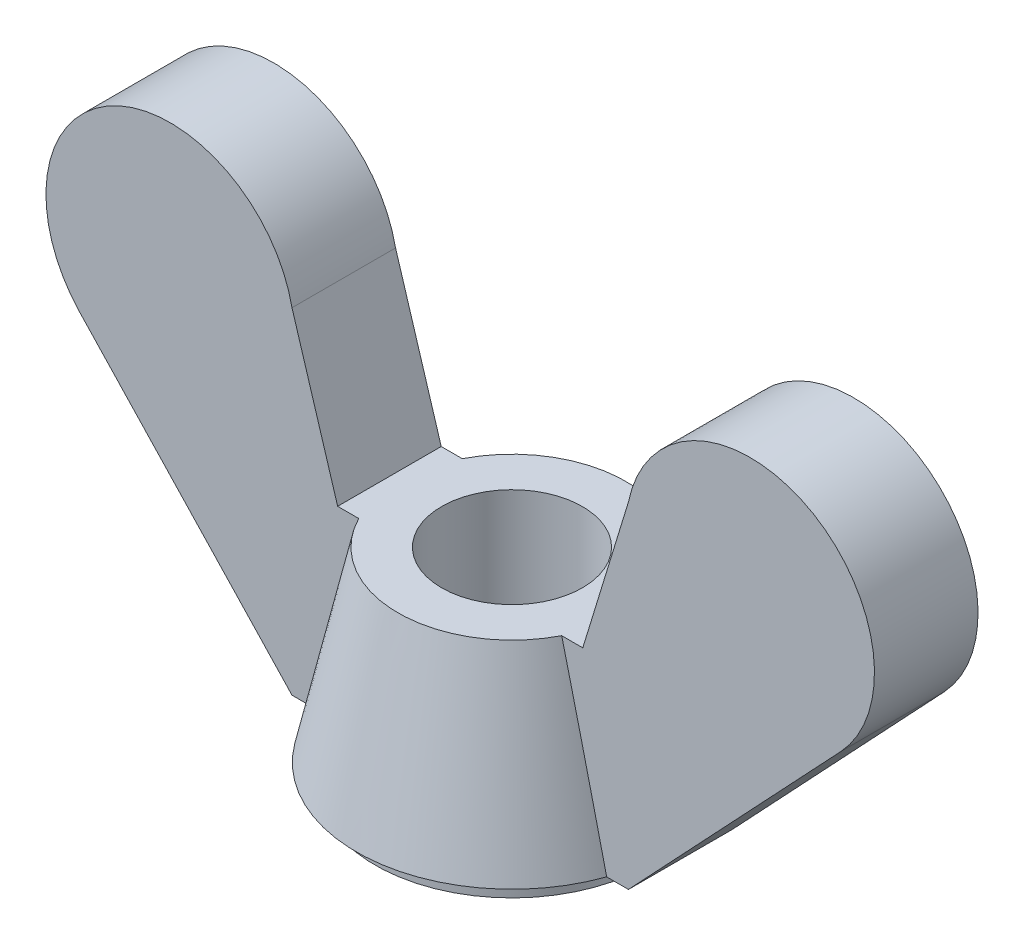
ISO-10303-21;
HEADER;
FILE_DESCRIPTION(('STEP AP214'),'2;1');
FILE_NAME('part.step','',(''),(''),'','','');
FILE_SCHEMA(('AUTOMOTIVE_DESIGN { 1 0 10303 214 1 1 1 1 }'));
ENDSEC;
DATA;
#1=APPLICATION_CONTEXT('core data for automotive mechanical design processes');
#2=APPLICATION_PROTOCOL_DEFINITION('international standard','automotive_design',2000,#1);
#3=PRODUCT_CONTEXT('',#1,'mechanical');
#4=PRODUCT('Part','Part','',(#3));
#5=PRODUCT_RELATED_PRODUCT_CATEGORY('part','',(#4));
#6=PRODUCT_DEFINITION_FORMATION('','',#4);
#7=PRODUCT_DEFINITION_CONTEXT('part definition',#1,'design');
#8=PRODUCT_DEFINITION('design','',#6,#7);
#9=PRODUCT_DEFINITION_SHAPE('','',#8);
#10=(LENGTH_UNIT() NAMED_UNIT(*) SI_UNIT(.MILLI.,.METRE.));
#11=(NAMED_UNIT(*) PLANE_ANGLE_UNIT() SI_UNIT($,.RADIAN.));
#12=(NAMED_UNIT(*) SI_UNIT($,.STERADIAN.) SOLID_ANGLE_UNIT());
#13=UNCERTAINTY_MEASURE_WITH_UNIT(LENGTH_MEASURE(1.E-05),#10,'distance_accuracy_value','');
#14=(GEOMETRIC_REPRESENTATION_CONTEXT(3) GLOBAL_UNCERTAINTY_ASSIGNED_CONTEXT((#13)) GLOBAL_UNIT_ASSIGNED_CONTEXT((#10,
#11,#12)) REPRESENTATION_CONTEXT('',''));
#15=CARTESIAN_POINT('',(0.,0.,0.));
#16=DIRECTION('',(0.,0.,1.));
#17=DIRECTION('',(1.,0.,0.));
#18=AXIS2_PLACEMENT_3D('',#15,#16,#17);
#19=CARTESIAN_POINT('',(0.,1.,0.));
#20=DIRECTION('',(0.,-1.,0.));
#21=DIRECTION('',(0.,0.,-1.));
#22=AXIS2_PLACEMENT_3D('',#19,#20,#21);
#23=CONICAL_SURFACE('',#22,7.5,0.218668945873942);
#24=CARTESIAN_POINT('',(0.,10.,0.));
#25=DIRECTION('',(0.,-1.,0.));
#26=DIRECTION('',(0.,0.,-1.));
#27=AXIS2_PLACEMENT_3D('',#24,#25,#26);
#28=CIRCLE('',#27,5.5);
#29=CARTESIAN_POINT('',(-4.89897948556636,10.,-2.5));
#30=VERTEX_POINT('',#29);
#31=CARTESIAN_POINT('',(4.89897948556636,10.,-2.5));
#32=VERTEX_POINT('',#31);
#33=EDGE_CURVE('E231',#30,#32,#28,.T.);
#34=ORIENTED_EDGE('',*,*,#33,.T.);
#35=CARTESIAN_POINT('',(3.9309370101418,13.7864391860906,-2.5));
#36=CARTESIAN_POINT('',(4.0121829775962,13.4779082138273,-2.5));
#37=CARTESIAN_POINT('',(4.09276538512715,13.1692034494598,-2.5));
#38=CARTESIAN_POINT('',(4.25278684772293,12.5514989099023,-2.5));
#39=CARTESIAN_POINT('',(4.33222590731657,12.242499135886,-2.5));
#40=CARTESIAN_POINT('',(4.56910244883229,11.3151411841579,-2.5));
#41=CARTESIAN_POINT('',(4.72510156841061,10.6964156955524,-2.5));
#42=CARTESIAN_POINT('',(5.03424789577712,9.45827789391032,-2.5));
#43=CARTESIAN_POINT('',(5.18739520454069,8.83886560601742,-2.5));
#44=CARTESIAN_POINT('',(5.49150237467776,7.59950246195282,-2.5));
#45=CARTESIAN_POINT('',(5.64246222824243,6.97955160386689,-2.5));
#46=CARTESIAN_POINT('',(5.95750029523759,5.67793179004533,-2.5));
#47=CARTESIAN_POINT('',(6.12140018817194,4.99621971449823,-2.5));
#48=CARTESIAN_POINT('',(6.44757017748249,3.63239887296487,-2.5));
#49=CARTESIAN_POINT('',(6.60984025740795,2.95029010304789,-2.5));
#50=CARTESIAN_POINT('',(6.99933811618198,1.30604131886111,-2.5));
#51=CARTESIAN_POINT('',(7.22592150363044,0.343748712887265,-2.5));
#52=CARTESIAN_POINT('',(7.67714018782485,-1.58129367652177,-2.5));
#53=CARTESIAN_POINT('',(7.90177548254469,-2.54404346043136,-2.5));
#54=CARTESIAN_POINT('',(8.34953415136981,-4.46986091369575,-2.5));
#55=CARTESIAN_POINT('',(8.57265757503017,-5.43292857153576,-2.5));
#56=CARTESIAN_POINT('',(9.01769816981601,-7.35933994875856,-2.5));
#57=CARTESIAN_POINT('',(9.23961534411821,-8.32268366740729,-2.5));
#58=CARTESIAN_POINT('',(9.46107907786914,-9.28613119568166,-2.5));
#59=B_SPLINE_CURVE_WITH_KNOTS('',3,(#35,#36,#37,#38,#39,#40,#41,#42,#43,#44,#45,#46,#47,#48,#49,
#50,#51,#52,#53,#54,#55,#56,#57,#58),.UNSPECIFIED.,.F.,.F.,(4,2,2,2,2,2,2,2,2,2,2,4),(0.,
0.95714489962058,1.91428600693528,3.8285412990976,5.74272868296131,7.65692289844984,
9.76033440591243,11.8637671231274,14.8295901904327,17.7954163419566,20.7611448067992,
23.7268654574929),.UNSPECIFIED.);
#60=CARTESIAN_POINT('',(7.07106781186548,1.,-2.5));
#61=VERTEX_POINT('',#60);
#62=EDGE_CURVE('E133',#32,#61,#59,.T.);
#63=ORIENTED_EDGE('',*,*,#62,.T.);
#64=CARTESIAN_POINT('',(0.,1.,0.));
#65=DIRECTION('',(0.,-1.,0.));
#66=DIRECTION('',(0.,0.,-1.));
#67=AXIS2_PLACEMENT_3D('',#64,#65,#66);
#68=CIRCLE('',#67,7.5);
#69=CARTESIAN_POINT('',(-7.07106781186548,1.,-2.5));
#70=VERTEX_POINT('',#69);
#71=EDGE_CURVE('E235',#70,#61,#68,.T.);
#72=ORIENTED_EDGE('',*,*,#71,.F.);
#73=CARTESIAN_POINT('',(-9.46107907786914,-9.28613119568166,-2.5));
#74=CARTESIAN_POINT('',(-9.23960640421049,-8.32264428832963,-2.5));
#75=CARTESIAN_POINT('',(-9.01768009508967,-7.35926124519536,-2.5));
#76=CARTESIAN_POINT('',(-8.57262214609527,-5.43277568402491,-2.5));
#77=CARTESIAN_POINT('',(-8.34949050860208,-4.46967316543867,-2.5));
#78=CARTESIAN_POINT('',(-7.90173281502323,-2.54385998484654,-2.5));
#79=CARTESIAN_POINT('',(-7.67710682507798,-1.58114930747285,-2.5));
#80=CARTESIAN_POINT('',(-7.22590463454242,0.343818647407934,-2.5));
#81=CARTESIAN_POINT('',(-6.99932842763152,1.3060759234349,-2.5));
#82=CARTESIAN_POINT('',(-6.54357636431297,3.23002662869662,-2.5));
#83=CARTESIAN_POINT('',(-6.31440037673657,4.19172002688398,-2.5));
#84=CARTESIAN_POINT('',(-5.85251092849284,6.11425116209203,-2.5));
#85=CARTESIAN_POINT('',(-5.61979749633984,7.07508890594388,-2.5));
#86=CARTESIAN_POINT('',(-5.26689744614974,8.51543264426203,-2.5));
#87=CARTESIAN_POINT('',(-5.14862280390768,8.99540694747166,-2.5));
#88=CARTESIAN_POINT('',(-4.91049880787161,9.95496363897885,-2.5));
#89=CARTESIAN_POINT('',(-4.79064945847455,10.4345460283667,-2.5));
#90=CARTESIAN_POINT('',(-4.5490056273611,11.3932353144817,-2.5));
#91=CARTESIAN_POINT('',(-4.42721109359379,11.8723421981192,-2.5));
#92=CARTESIAN_POINT('',(-4.18110501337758,12.8299134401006,-2.5));
#93=CARTESIAN_POINT('',(-4.05679344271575,13.3083777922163,-2.5));
#94=CARTESIAN_POINT('',(-3.9309370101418,13.7864391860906,-2.5));
#95=B_SPLINE_CURVE_WITH_KNOTS('',3,(#73,#74,#75,#76,#77,#78,#79,#80,#81,#82,#83,#84,#85,#86,#87,
#88,#89,#90,#91,#92,#93,#94),.UNSPECIFIED.,.F.,.F.,(4,2,2,2,2,2,2,2,2,2,4),(0.,2.96584177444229,
5.93167769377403,8.89738320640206,11.8630983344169,14.8289637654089,17.7948053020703,
19.277799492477,20.7607895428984,22.2438193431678,23.7268634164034),.UNSPECIFIED.);
#96=EDGE_CURVE('E220',#70,#30,#95,.T.);
#97=ORIENTED_EDGE('',*,*,#96,.T.);
#98=EDGE_LOOP('',(#34,#63,#72,#97));
#99=FACE_BOUND('',#98,.T.);
#100=ADVANCED_FACE('F35',(#99),#23,.T.);
#101=CARTESIAN_POINT('',(0.,0.,0.));
#102=DIRECTION('',(0.,-1.,0.));
#103=DIRECTION('',(0.,0.,-1.));
#104=AXIS2_PLACEMENT_3D('',#101,#102,#103);
#105=PLANE('',#104);
#106=CARTESIAN_POINT('',(0.,0.,0.));
#107=DIRECTION('',(0.,1.,0.));
#108=DIRECTION('',(0.,0.,1.));
#109=AXIS2_PLACEMENT_3D('',#106,#107,#108);
#110=CIRCLE('',#109,3.4);
#111=CARTESIAN_POINT('',(0.,0.,3.4));
#112=VERTEX_POINT('',#111);
#113=EDGE_CURVE('E227',#112,#112,#110,.T.);
#114=ORIENTED_EDGE('',*,*,#113,.T.);
#115=EDGE_LOOP('',(#114));
#116=FACE_BOUND('',#115,.T.);
#117=CARTESIAN_POINT('',(0.,0.,0.));
#118=DIRECTION('',(0.,-1.,0.));
#119=DIRECTION('',(0.,0.,-1.));
#120=AXIS2_PLACEMENT_3D('',#117,#118,#119);
#121=CIRCLE('',#120,6.6);
#122=CARTESIAN_POINT('',(0.,0.,-6.6));
#123=VERTEX_POINT('',#122);
#124=EDGE_CURVE('E11',#123,#123,#121,.T.);
#125=ORIENTED_EDGE('',*,*,#124,.T.);
#126=EDGE_LOOP('',(#125));
#127=FACE_BOUND('',#126,.T.);
#128=ADVANCED_FACE('F37',(#116,#127),#105,.T.);
#129=CARTESIAN_POINT('',(0.,0.,0.));
#130=DIRECTION('',(0.,-1.,0.));
#131=DIRECTION('',(0.,0.,-1.));
#132=AXIS2_PLACEMENT_3D('',#129,#130,#131);
#133=CYLINDRICAL_SURFACE('',#132,6.6);
#134=CARTESIAN_POINT('',(0.,1.,0.));
#135=DIRECTION('',(0.,-1.,0.));
#136=DIRECTION('',(0.,0.,-1.));
#137=AXIS2_PLACEMENT_3D('',#134,#135,#136);
#138=CIRCLE('',#137,6.6);
#139=CARTESIAN_POINT('',(0.,1.,-6.6));
#140=VERTEX_POINT('',#139);
#141=EDGE_CURVE('E43',#140,#140,#138,.T.);
#142=ORIENTED_EDGE('',*,*,#141,.T.);
#143=EDGE_LOOP('',(#142));
#144=FACE_BOUND('',#143,.T.);
#145=ORIENTED_EDGE('',*,*,#124,.F.);
#146=EDGE_LOOP('',(#145));
#147=FACE_BOUND('',#146,.T.);
#148=ADVANCED_FACE('F239',(#144,#147),#133,.T.);
#149=CARTESIAN_POINT('',(6.6,1.,0.));
#150=DIRECTION('',(0.,-1.,0.));
#151=DIRECTION('',(0.,0.,-1.));
#152=AXIS2_PLACEMENT_3D('',#149,#150,#151);
#153=PLANE('',#152);
#154=ORIENTED_EDGE('',*,*,#141,.F.);
#155=EDGE_LOOP('',(#154));
#156=FACE_BOUND('',#155,.T.);
#157=DIRECTION('',(-1.,0.,0.));
#158=VECTOR('',#157,1.);
#159=CARTESIAN_POINT('',(5.51083691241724,1.,2.5));
#160=LINE('',#159,#158);
#161=CARTESIAN_POINT('',(8.12131645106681,1.,2.5));
#162=VERTEX_POINT('',#161);
#163=CARTESIAN_POINT('',(7.07106781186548,1.,2.5));
#164=VERTEX_POINT('',#163);
#165=EDGE_CURVE('E127',#162,#164,#160,.T.);
#166=ORIENTED_EDGE('',*,*,#165,.T.);
#167=CARTESIAN_POINT('',(-7.07106781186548,1.,2.5));
#168=VERTEX_POINT('',#167);
#169=EDGE_CURVE('E234',#164,#168,#68,.T.);
#170=ORIENTED_EDGE('',*,*,#169,.T.);
#171=DIRECTION('',(1.,0.,0.));
#172=VECTOR('',#171,1.);
#173=CARTESIAN_POINT('',(-5.51083691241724,1.,2.5));
#174=LINE('',#173,#172);
#175=CARTESIAN_POINT('',(-8.12131645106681,1.,2.5));
#176=VERTEX_POINT('',#175);
#177=EDGE_CURVE('E274',#176,#168,#174,.T.);
#178=ORIENTED_EDGE('',*,*,#177,.F.);
#179=DIRECTION('',(0.,0.,-1.));
#180=VECTOR('',#179,1.);
#181=CARTESIAN_POINT('',(-8.12131645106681,1.,2.5));
#182=LINE('',#181,#180);
#183=CARTESIAN_POINT('',(-8.12131645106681,1.,-2.5));
#184=VERTEX_POINT('',#183);
#185=EDGE_CURVE('E284',#176,#184,#182,.T.);
#186=ORIENTED_EDGE('',*,*,#185,.T.);
#187=DIRECTION('',(1.,0.,0.));
#188=VECTOR('',#187,1.);
#189=CARTESIAN_POINT('',(-5.51083691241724,1.,-2.5));
#190=LINE('',#189,#188);
#191=EDGE_CURVE('E268',#184,#70,#190,.T.);
#192=ORIENTED_EDGE('',*,*,#191,.T.);
#193=ORIENTED_EDGE('',*,*,#71,.T.);
#194=DIRECTION('',(-1.,0.,0.));
#195=VECTOR('',#194,1.);
#196=CARTESIAN_POINT('',(5.51083691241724,1.,-2.5));
#197=LINE('',#196,#195);
#198=CARTESIAN_POINT('',(8.12131645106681,1.,-2.5));
#199=VERTEX_POINT('',#198);
#200=EDGE_CURVE('E50',#199,#61,#197,.T.);
#201=ORIENTED_EDGE('',*,*,#200,.F.);
#202=DIRECTION('',(0.,0.,-1.));
#203=VECTOR('',#202,1.);
#204=CARTESIAN_POINT('',(8.12131645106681,1.,2.5));
#205=LINE('',#204,#203);
#206=EDGE_CURVE('E124',#162,#199,#205,.T.);
#207=ORIENTED_EDGE('',*,*,#206,.F.);
#208=EDGE_LOOP('',(#166,#170,#178,#186,#192,#193,#201,#207));
#209=FACE_BOUND('',#208,.T.);
#210=ADVANCED_FACE('F126',(#156,#209),#153,.T.);
#211=CARTESIAN_POINT('',(3.9309370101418,13.7864391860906,2.5));
#212=CARTESIAN_POINT('',(4.0121829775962,13.4779082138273,2.5));
#213=CARTESIAN_POINT('',(4.09276538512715,13.1692034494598,2.5));
#214=CARTESIAN_POINT('',(4.25278684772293,12.5514989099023,2.5));
#215=CARTESIAN_POINT('',(4.33222590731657,12.242499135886,2.5));
#216=CARTESIAN_POINT('',(4.56910244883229,11.3151411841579,2.5));
#217=CARTESIAN_POINT('',(4.72510156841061,10.6964156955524,2.5));
#218=CARTESIAN_POINT('',(5.03424789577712,9.45827789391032,2.5));
#219=CARTESIAN_POINT('',(5.18739520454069,8.83886560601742,2.5));
#220=CARTESIAN_POINT('',(5.49150237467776,7.59950246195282,2.5));
#221=CARTESIAN_POINT('',(5.64246222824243,6.97955160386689,2.5));
#222=CARTESIAN_POINT('',(5.95750029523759,5.67793179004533,2.5));
#223=CARTESIAN_POINT('',(6.12140018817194,4.99621971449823,2.5));
#224=CARTESIAN_POINT('',(6.44757017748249,3.63239887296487,2.5));
#225=CARTESIAN_POINT('',(6.60984025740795,2.95029010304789,2.5));
#226=CARTESIAN_POINT('',(6.99933811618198,1.30604131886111,2.5));
#227=CARTESIAN_POINT('',(7.22592150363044,0.343748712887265,2.5));
#228=CARTESIAN_POINT('',(7.67714018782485,-1.58129367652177,2.5));
#229=CARTESIAN_POINT('',(7.90177548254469,-2.54404346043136,2.5));
#230=CARTESIAN_POINT('',(8.34953415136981,-4.46986091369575,2.5));
#231=CARTESIAN_POINT('',(8.57265757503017,-5.43292857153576,2.5));
#232=CARTESIAN_POINT('',(9.01769816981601,-7.35933994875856,2.5));
#233=CARTESIAN_POINT('',(9.23961534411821,-8.32268366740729,2.5));
#234=CARTESIAN_POINT('',(9.46107907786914,-9.28613119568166,2.5));
#235=B_SPLINE_CURVE_WITH_KNOTS('',3,(#211,#212,#213,#214,#215,#216,#217,#218,#219,#220,#221,
#222,#223,#224,#225,#226,#227,#228,#229,#230,#231,#232,#233,#234),.UNSPECIFIED.,.F.,.F.,(4,2,2,
2,2,2,2,2,2,2,2,4),(0.,0.95714489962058,1.91428600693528,3.8285412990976,5.74272868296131,
7.65692289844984,9.76033440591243,11.8637671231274,14.8295901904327,17.7954163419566,
20.7611448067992,23.7268654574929),.UNSPECIFIED.);
#236=CARTESIAN_POINT('',(4.89897948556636,10.,2.5));
#237=VERTEX_POINT('',#236);
#238=EDGE_CURVE('E143',#237,#164,#235,.T.);
#239=ORIENTED_EDGE('',*,*,#238,.F.);
#240=CARTESIAN_POINT('',(-4.89897948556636,10.,2.5));
#241=VERTEX_POINT('',#240);
#242=EDGE_CURVE('E230',#237,#241,#28,.T.);
#243=ORIENTED_EDGE('',*,*,#242,.T.);
#244=CARTESIAN_POINT('',(-9.46107907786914,-9.28613119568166,2.5));
#245=CARTESIAN_POINT('',(-9.23960640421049,-8.32264428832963,2.5));
#246=CARTESIAN_POINT('',(-9.01768009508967,-7.35926124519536,2.5));
#247=CARTESIAN_POINT('',(-8.57262214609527,-5.43277568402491,2.5));
#248=CARTESIAN_POINT('',(-8.34949050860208,-4.46967316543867,2.5));
#249=CARTESIAN_POINT('',(-7.90173281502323,-2.54385998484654,2.5));
#250=CARTESIAN_POINT('',(-7.67710682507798,-1.58114930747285,2.5));
#251=CARTESIAN_POINT('',(-7.22590463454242,0.343818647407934,2.5));
#252=CARTESIAN_POINT('',(-6.99932842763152,1.3060759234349,2.5));
#253=CARTESIAN_POINT('',(-6.54357636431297,3.23002662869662,2.5));
#254=CARTESIAN_POINT('',(-6.31440037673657,4.19172002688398,2.5));
#255=CARTESIAN_POINT('',(-5.85251092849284,6.11425116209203,2.5));
#256=CARTESIAN_POINT('',(-5.61979749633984,7.07508890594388,2.5));
#257=CARTESIAN_POINT('',(-5.26689744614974,8.51543264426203,2.5));
#258=CARTESIAN_POINT('',(-5.14862280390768,8.99540694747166,2.5));
#259=CARTESIAN_POINT('',(-4.91049880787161,9.95496363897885,2.5));
#260=CARTESIAN_POINT('',(-4.79064945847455,10.4345460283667,2.5));
#261=CARTESIAN_POINT('',(-4.5490056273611,11.3932353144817,2.5));
#262=CARTESIAN_POINT('',(-4.42721109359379,11.8723421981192,2.5));
#263=CARTESIAN_POINT('',(-4.18110501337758,12.8299134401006,2.5));
#264=CARTESIAN_POINT('',(-4.05679344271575,13.3083777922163,2.5));
#265=CARTESIAN_POINT('',(-3.9309370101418,13.7864391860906,2.5));
#266=B_SPLINE_CURVE_WITH_KNOTS('',3,(#244,#245,#246,#247,#248,#249,#250,#251,#252,#253,#254,
#255,#256,#257,#258,#259,#260,#261,#262,#263,#264,#265),.UNSPECIFIED.,.F.,.F.,(4,2,2,2,2,2,2,2,
2,2,4),(0.,2.96584177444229,5.93167769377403,8.89738320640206,11.8630983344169,14.8289637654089,
17.7948053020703,19.277799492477,20.7607895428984,22.2438193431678,23.7268634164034),.UNSPECIFIED.);
#267=EDGE_CURVE('E212',#168,#241,#266,.T.);
#268=ORIENTED_EDGE('',*,*,#267,.F.);
#269=ORIENTED_EDGE('',*,*,#169,.F.);
#270=EDGE_LOOP('',(#239,#243,#268,#269));
#271=FACE_BOUND('',#270,.T.);
#272=ADVANCED_FACE('F183',(#271),#23,.T.);
#273=CARTESIAN_POINT('',(0.,10.,0.));
#274=DIRECTION('',(0.,1.,0.));
#275=DIRECTION('',(0.,0.,1.));
#276=AXIS2_PLACEMENT_3D('',#273,#274,#275);
#277=PLANE('',#276);
#278=ORIENTED_EDGE('',*,*,#242,.F.);
#279=DIRECTION('',(1.,0.,0.));
#280=VECTOR('',#279,1.);
#281=CARTESIAN_POINT('',(4.84953648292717,10.,2.5));
#282=LINE('',#281,#280);
#283=CARTESIAN_POINT('',(5.91706089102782,10.,2.5));
#284=VERTEX_POINT('',#283);
#285=EDGE_CURVE('E154',#237,#284,#282,.T.);
#286=ORIENTED_EDGE('',*,*,#285,.T.);
#287=DIRECTION('',(0.,0.,-1.));
#288=VECTOR('',#287,1.);
#289=CARTESIAN_POINT('',(5.91706089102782,10.,2.5));
#290=LINE('',#289,#288);
#291=CARTESIAN_POINT('',(5.91706089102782,10.,-2.5));
#292=VERTEX_POINT('',#291);
#293=EDGE_CURVE('E156',#284,#292,#290,.T.);
#294=ORIENTED_EDGE('',*,*,#293,.T.);
#295=DIRECTION('',(1.,0.,0.));
#296=VECTOR('',#295,1.);
#297=CARTESIAN_POINT('',(4.84953648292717,10.,-2.5));
#298=LINE('',#297,#296);
#299=EDGE_CURVE('E144',#32,#292,#298,.T.);
#300=ORIENTED_EDGE('',*,*,#299,.F.);
#301=ORIENTED_EDGE('',*,*,#33,.F.);
#302=DIRECTION('',(-1.,0.,0.));
#303=VECTOR('',#302,1.);
#304=CARTESIAN_POINT('',(-4.84953648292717,10.,-2.5));
#305=LINE('',#304,#303);
#306=CARTESIAN_POINT('',(-5.91706089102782,10.,-2.5));
#307=VERTEX_POINT('',#306);
#308=EDGE_CURVE('E58',#30,#307,#305,.T.);
#309=ORIENTED_EDGE('',*,*,#308,.T.);
#310=DIRECTION('',(0.,0.,-1.));
#311=VECTOR('',#310,1.);
#312=CARTESIAN_POINT('',(-5.91706089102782,10.,2.5));
#313=LINE('',#312,#311);
#314=CARTESIAN_POINT('',(-5.91706089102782,10.,2.5));
#315=VERTEX_POINT('',#314);
#316=EDGE_CURVE('E271',#315,#307,#313,.T.);
#317=ORIENTED_EDGE('',*,*,#316,.F.);
#318=DIRECTION('',(-1.,0.,0.));
#319=VECTOR('',#318,1.);
#320=CARTESIAN_POINT('',(-4.84953648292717,10.,2.5));
#321=LINE('',#320,#319);
#322=EDGE_CURVE('E270',#241,#315,#321,.T.);
#323=ORIENTED_EDGE('',*,*,#322,.F.);
#324=EDGE_LOOP('',(#278,#286,#294,#300,#301,#309,#317,#323));
#325=FACE_BOUND('',#324,.T.);
#326=CARTESIAN_POINT('',(0.,10.,0.));
#327=DIRECTION('',(0.,1.,0.));
#328=DIRECTION('',(0.,0.,1.));
#329=AXIS2_PLACEMENT_3D('',#326,#327,#328);
#330=CIRCLE('',#329,3.39999999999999);
#331=CARTESIAN_POINT('',(0.,10.,3.39999999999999));
#332=VERTEX_POINT('',#331);
#333=EDGE_CURVE('E219',#332,#332,#330,.T.);
#334=ORIENTED_EDGE('',*,*,#333,.F.);
#335=EDGE_LOOP('',(#334));
#336=FACE_BOUND('',#335,.T.);
#337=ADVANCED_FACE('F247',(#325,#336),#277,.T.);
#338=CARTESIAN_POINT('',(0.,10.,0.));
#339=DIRECTION('',(0.,1.,0.));
#340=DIRECTION('',(0.,0.,1.));
#341=AXIS2_PLACEMENT_3D('',#338,#339,#340);
#342=CYLINDRICAL_SURFACE('',#341,3.39999999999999);
#343=ORIENTED_EDGE('',*,*,#113,.F.);
#344=EDGE_LOOP('',(#343));
#345=FACE_BOUND('',#344,.T.);
#346=ORIENTED_EDGE('',*,*,#333,.T.);
#347=EDGE_LOOP('',(#346));
#348=FACE_BOUND('',#347,.T.);
#349=ADVANCED_FACE('F322',(#345,#348),#342,.F.);
#350=CARTESIAN_POINT('',(-5.91706089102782,10.,2.5));
#351=DIRECTION('',(-0.956198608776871,-0.292718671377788,0.));
#352=DIRECTION('',(0.292718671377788,-0.956198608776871,0.));
#353=AXIS2_PLACEMENT_3D('',#350,#351,#352);
#354=PLANE('',#353);
#355=DIRECTION('',(-0.292718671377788,0.956198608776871,0.));
#356=VECTOR('',#355,1.);
#357=CARTESIAN_POINT('',(-5.91706089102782,10.,-2.5));
#358=LINE('',#357,#356);
#359=CARTESIAN_POINT('',(-8.12131645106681,17.2004498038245,-2.5));
#360=VERTEX_POINT('',#359);
#361=EDGE_CURVE('E288',#307,#360,#358,.T.);
#362=ORIENTED_EDGE('',*,*,#361,.T.);
#363=DIRECTION('',(0.,0.,-1.));
#364=VECTOR('',#363,1.);
#365=CARTESIAN_POINT('',(-8.12131645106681,17.2004498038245,2.5));
#366=LINE('',#365,#364);
#367=CARTESIAN_POINT('',(-8.12131645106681,17.2004498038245,2.5));
#368=VERTEX_POINT('',#367);
#369=EDGE_CURVE('E298',#368,#360,#366,.T.);
#370=ORIENTED_EDGE('',*,*,#369,.F.);
#371=DIRECTION('',(-0.292718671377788,0.956198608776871,0.));
#372=VECTOR('',#371,1.);
#373=CARTESIAN_POINT('',(-5.91706089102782,10.,2.5));
#374=LINE('',#373,#372);
#375=EDGE_CURVE('E273',#315,#368,#374,.T.);
#376=ORIENTED_EDGE('',*,*,#375,.F.);
#377=ORIENTED_EDGE('',*,*,#316,.T.);
#378=EDGE_LOOP('',(#362,#370,#376,#377));
#379=FACE_BOUND('',#378,.T.);
#380=ADVANCED_FACE('F301',(#379),#354,.F.);
#381=CARTESIAN_POINT('',(-14.,16.,2.5));
#382=DIRECTION('',(0.,0.,-1.));
#383=DIRECTION('',(-1.,0.,0.));
#384=AXIS2_PLACEMENT_3D('',#381,#382,#383);
#385=CYLINDRICAL_SURFACE('',#384,6.);
#386=CARTESIAN_POINT('',(-14.,16.,-2.5));
#387=DIRECTION('',(0.,0.,1.));
#388=DIRECTION('',(1.,0.,0.));
#389=AXIS2_PLACEMENT_3D('',#386,#387,#388);
#390=CIRCLE('',#389,6.);
#391=CARTESIAN_POINT('',(-18.3690935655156,11.8876987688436,-2.5));
#392=VERTEX_POINT('',#391);
#393=EDGE_CURVE('E290',#360,#392,#390,.T.);
#394=ORIENTED_EDGE('',*,*,#393,.T.);
#395=DIRECTION('',(0.,0.,-1.));
#396=VECTOR('',#395,1.);
#397=CARTESIAN_POINT('',(-18.3690935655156,11.8876987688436,2.5));
#398=LINE('',#397,#396);
#399=CARTESIAN_POINT('',(-18.3690935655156,11.8876987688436,2.5));
#400=VERTEX_POINT('',#399);
#401=EDGE_CURVE('E295',#400,#392,#398,.T.);
#402=ORIENTED_EDGE('',*,*,#401,.F.);
#403=CARTESIAN_POINT('',(-14.,16.,2.5));
#404=DIRECTION('',(0.,0.,1.));
#405=DIRECTION('',(1.,0.,0.));
#406=AXIS2_PLACEMENT_3D('',#403,#404,#405);
#407=CIRCLE('',#406,6.);
#408=EDGE_CURVE('E276',#368,#400,#407,.T.);
#409=ORIENTED_EDGE('',*,*,#408,.F.);
#410=ORIENTED_EDGE('',*,*,#369,.T.);
#411=EDGE_LOOP('',(#394,#402,#409,#410));
#412=FACE_BOUND('',#411,.T.);
#413=ADVANCED_FACE('F308',(#412),#385,.T.);
#414=CARTESIAN_POINT('',(-8.12131645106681,1.,2.5));
#415=DIRECTION('',(0.72818226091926,0.685383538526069,0.));
#416=DIRECTION('',(-0.685383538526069,0.72818226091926,0.));
#417=AXIS2_PLACEMENT_3D('',#414,#415,#416);
#418=PLANE('',#417);
#419=DIRECTION('',(0.685383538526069,-0.72818226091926,0.));
#420=VECTOR('',#419,1.);
#421=CARTESIAN_POINT('',(-8.12131645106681,1.,-2.5));
#422=LINE('',#421,#420);
#423=EDGE_CURVE('E279',#392,#184,#422,.T.);
#424=ORIENTED_EDGE('',*,*,#423,.T.);
#425=ORIENTED_EDGE('',*,*,#185,.F.);
#426=DIRECTION('',(0.685383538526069,-0.72818226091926,0.));
#427=VECTOR('',#426,1.);
#428=CARTESIAN_POINT('',(-8.12131645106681,1.,2.5));
#429=LINE('',#428,#427);
#430=EDGE_CURVE('E282',#400,#176,#429,.T.);
#431=ORIENTED_EDGE('',*,*,#430,.F.);
#432=ORIENTED_EDGE('',*,*,#401,.T.);
#433=EDGE_LOOP('',(#424,#425,#431,#432));
#434=FACE_BOUND('',#433,.T.);
#435=ADVANCED_FACE('F207',(#434),#418,.F.);
#436=CARTESIAN_POINT('',(-14.,16.,2.5));
#437=DIRECTION('',(0.,0.,1.));
#438=DIRECTION('',(1.,0.,0.));
#439=AXIS2_PLACEMENT_3D('',#436,#437,#438);
#440=PLANE('',#439);
#441=ORIENTED_EDGE('',*,*,#177,.T.);
#442=ORIENTED_EDGE('',*,*,#267,.T.);
#443=ORIENTED_EDGE('',*,*,#322,.T.);
#444=ORIENTED_EDGE('',*,*,#375,.T.);
#445=ORIENTED_EDGE('',*,*,#408,.T.);
#446=ORIENTED_EDGE('',*,*,#430,.T.);
#447=EDGE_LOOP('',(#441,#442,#443,#444,#445,#446));
#448=FACE_BOUND('',#447,.T.);
#449=ADVANCED_FACE('F203',(#448),#440,.T.);
#450=CARTESIAN_POINT('',(-14.,16.,-2.5));
#451=DIRECTION('',(0.,0.,1.));
#452=DIRECTION('',(1.,0.,0.));
#453=AXIS2_PLACEMENT_3D('',#450,#451,#452);
#454=PLANE('',#453);
#455=ORIENTED_EDGE('',*,*,#96,.F.);
#456=ORIENTED_EDGE('',*,*,#191,.F.);
#457=ORIENTED_EDGE('',*,*,#423,.F.);
#458=ORIENTED_EDGE('',*,*,#393,.F.);
#459=ORIENTED_EDGE('',*,*,#361,.F.);
#460=ORIENTED_EDGE('',*,*,#308,.F.);
#461=EDGE_LOOP('',(#455,#456,#457,#458,#459,#460));
#462=FACE_BOUND('',#461,.T.);
#463=ADVANCED_FACE('F202',(#462),#454,.F.);
#464=CARTESIAN_POINT('',(8.12131645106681,1.,2.5));
#465=DIRECTION('',(0.72818226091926,-0.685383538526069,0.));
#466=DIRECTION('',(0.685383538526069,0.72818226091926,0.));
#467=AXIS2_PLACEMENT_3D('',#464,#465,#466);
#468=PLANE('',#467);
#469=DIRECTION('',(-0.685383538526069,-0.72818226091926,0.));
#470=VECTOR('',#469,1.);
#471=CARTESIAN_POINT('',(8.12131645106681,1.,-2.5));
#472=LINE('',#471,#470);
#473=CARTESIAN_POINT('',(18.3690935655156,11.8876987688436,-2.5));
#474=VERTEX_POINT('',#473);
#475=EDGE_CURVE('E158',#474,#199,#472,.T.);
#476=ORIENTED_EDGE('',*,*,#475,.F.);
#477=DIRECTION('',(0.,0.,-1.));
#478=VECTOR('',#477,1.);
#479=CARTESIAN_POINT('',(18.3690935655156,11.8876987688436,2.5));
#480=LINE('',#479,#478);
#481=CARTESIAN_POINT('',(18.3690935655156,11.8876987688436,2.5));
#482=VERTEX_POINT('',#481);
#483=EDGE_CURVE('E134',#482,#474,#480,.T.);
#484=ORIENTED_EDGE('',*,*,#483,.F.);
#485=DIRECTION('',(-0.685383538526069,-0.72818226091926,0.));
#486=VECTOR('',#485,1.);
#487=CARTESIAN_POINT('',(8.12131645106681,1.,2.5));
#488=LINE('',#487,#486);
#489=EDGE_CURVE('E140',#482,#162,#488,.T.);
#490=ORIENTED_EDGE('',*,*,#489,.T.);
#491=ORIENTED_EDGE('',*,*,#206,.T.);
#492=EDGE_LOOP('',(#476,#484,#490,#491));
#493=FACE_BOUND('',#492,.T.);
#494=ADVANCED_FACE('F146',(#493),#468,.T.);
#495=CARTESIAN_POINT('',(14.,16.,2.5));
#496=DIRECTION('',(0.,0.,-1.));
#497=DIRECTION('',(-1.,0.,0.));
#498=AXIS2_PLACEMENT_3D('',#495,#496,#497);
#499=CYLINDRICAL_SURFACE('',#498,6.);
#500=CARTESIAN_POINT('',(14.,16.,-2.5));
#501=DIRECTION('',(0.,0.,-1.));
#502=DIRECTION('',(-1.,0.,0.));
#503=AXIS2_PLACEMENT_3D('',#500,#501,#502);
#504=CIRCLE('',#503,6.);
#505=CARTESIAN_POINT('',(8.12131645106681,17.2004498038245,-2.5));
#506=VERTEX_POINT('',#505);
#507=EDGE_CURVE('E160',#506,#474,#504,.T.);
#508=ORIENTED_EDGE('',*,*,#507,.F.);
#509=DIRECTION('',(0.,0.,-1.));
#510=VECTOR('',#509,1.);
#511=CARTESIAN_POINT('',(8.12131645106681,17.2004498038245,2.5));
#512=LINE('',#511,#510);
#513=CARTESIAN_POINT('',(8.12131645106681,17.2004498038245,2.5));
#514=VERTEX_POINT('',#513);
#515=EDGE_CURVE('E169',#514,#506,#512,.T.);
#516=ORIENTED_EDGE('',*,*,#515,.F.);
#517=CARTESIAN_POINT('',(14.,16.,2.5));
#518=DIRECTION('',(0.,0.,-1.));
#519=DIRECTION('',(-1.,0.,0.));
#520=AXIS2_PLACEMENT_3D('',#517,#518,#519);
#521=CIRCLE('',#520,6.);
#522=EDGE_CURVE('E147',#514,#482,#521,.T.);
#523=ORIENTED_EDGE('',*,*,#522,.T.);
#524=ORIENTED_EDGE('',*,*,#483,.T.);
#525=EDGE_LOOP('',(#508,#516,#523,#524));
#526=FACE_BOUND('',#525,.T.);
#527=ADVANCED_FACE('F195',(#526),#499,.T.);
#528=CARTESIAN_POINT('',(5.91706089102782,10.,2.5));
#529=DIRECTION('',(-0.956198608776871,0.292718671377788,0.));
#530=DIRECTION('',(-0.292718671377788,-0.956198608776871,0.));
#531=AXIS2_PLACEMENT_3D('',#528,#529,#530);
#532=PLANE('',#531);
#533=DIRECTION('',(0.292718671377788,0.956198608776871,0.));
#534=VECTOR('',#533,1.);
#535=CARTESIAN_POINT('',(5.91706089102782,10.,-2.5));
#536=LINE('',#535,#534);
#537=EDGE_CURVE('E163',#292,#506,#536,.T.);
#538=ORIENTED_EDGE('',*,*,#537,.F.);
#539=ORIENTED_EDGE('',*,*,#293,.F.);
#540=DIRECTION('',(0.292718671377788,0.956198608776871,0.));
#541=VECTOR('',#540,1.);
#542=CARTESIAN_POINT('',(5.91706089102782,10.,2.5));
#543=LINE('',#542,#541);
#544=EDGE_CURVE('E149',#284,#514,#543,.T.);
#545=ORIENTED_EDGE('',*,*,#544,.T.);
#546=ORIENTED_EDGE('',*,*,#515,.T.);
#547=EDGE_LOOP('',(#538,#539,#545,#546));
#548=FACE_BOUND('',#547,.T.);
#549=ADVANCED_FACE('F192',(#548),#532,.T.);
#550=CARTESIAN_POINT('',(14.,16.,2.5));
#551=DIRECTION('',(0.,0.,1.));
#552=DIRECTION('',(-1.,0.,0.));
#553=AXIS2_PLACEMENT_3D('',#550,#551,#552);
#554=PLANE('',#553);
#555=ORIENTED_EDGE('',*,*,#285,.F.);
#556=ORIENTED_EDGE('',*,*,#238,.T.);
#557=ORIENTED_EDGE('',*,*,#165,.F.);
#558=ORIENTED_EDGE('',*,*,#489,.F.);
#559=ORIENTED_EDGE('',*,*,#522,.F.);
#560=ORIENTED_EDGE('',*,*,#544,.F.);
#561=EDGE_LOOP('',(#555,#556,#557,#558,#559,#560));
#562=FACE_BOUND('',#561,.T.);
#563=ADVANCED_FACE('F138',(#562),#554,.T.);
#564=CARTESIAN_POINT('',(14.,16.,-2.5));
#565=DIRECTION('',(0.,0.,1.));
#566=DIRECTION('',(-1.,0.,0.));
#567=AXIS2_PLACEMENT_3D('',#564,#565,#566);
#568=PLANE('',#567);
#569=ORIENTED_EDGE('',*,*,#62,.F.);
#570=ORIENTED_EDGE('',*,*,#299,.T.);
#571=ORIENTED_EDGE('',*,*,#537,.T.);
#572=ORIENTED_EDGE('',*,*,#507,.T.);
#573=ORIENTED_EDGE('',*,*,#475,.T.);
#574=ORIENTED_EDGE('',*,*,#200,.T.);
#575=EDGE_LOOP('',(#569,#570,#571,#572,#573,#574));
#576=FACE_BOUND('',#575,.T.);
#577=ADVANCED_FACE('F187',(#576),#568,.F.);
#578=CLOSED_SHELL('',(#100,#128,#148,#210,#272,#337,#349,#380,#413,#435,#449,#463,#494,#527,
#549,#563,#577));
#579=MANIFOLD_SOLID_BREP('B2',#578);
#580=ADVANCED_BREP_SHAPE_REPRESENTATION('',(#18,#579),#14);
#581=SHAPE_DEFINITION_REPRESENTATION(#9,#580);
ENDSEC;
END-ISO-10303-21;
